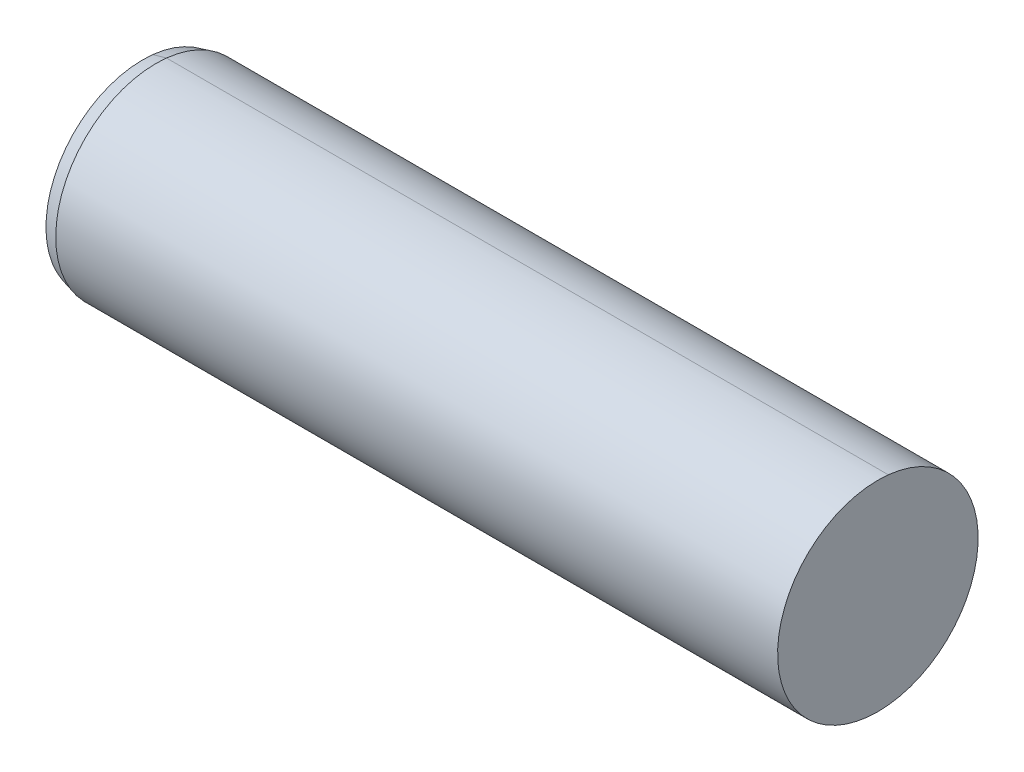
ISO-10303-21;
HEADER;
FILE_DESCRIPTION(('STEP AP214'),'2;1');
FILE_NAME('part.step','',(''),(''),'','','');
FILE_SCHEMA(('AUTOMOTIVE_DESIGN { 1 0 10303 214 1 1 1 1 }'));
ENDSEC;
DATA;
#1=APPLICATION_CONTEXT('core data for automotive mechanical design processes');
#2=APPLICATION_PROTOCOL_DEFINITION('international standard','automotive_design',2000,#1);
#3=PRODUCT_CONTEXT('',#1,'mechanical');
#4=PRODUCT('Part','Part','',(#3));
#5=PRODUCT_RELATED_PRODUCT_CATEGORY('part','',(#4));
#6=PRODUCT_DEFINITION_FORMATION('','',#4);
#7=PRODUCT_DEFINITION_CONTEXT('part definition',#1,'design');
#8=PRODUCT_DEFINITION('design','',#6,#7);
#9=PRODUCT_DEFINITION_SHAPE('','',#8);
#10=(LENGTH_UNIT() NAMED_UNIT(*) SI_UNIT(.MILLI.,.METRE.));
#11=(NAMED_UNIT(*) PLANE_ANGLE_UNIT() SI_UNIT($,.RADIAN.));
#12=(NAMED_UNIT(*) SI_UNIT($,.STERADIAN.) SOLID_ANGLE_UNIT());
#13=UNCERTAINTY_MEASURE_WITH_UNIT(LENGTH_MEASURE(1.E-05),#10,'distance_accuracy_value','');
#14=(GEOMETRIC_REPRESENTATION_CONTEXT(3) GLOBAL_UNCERTAINTY_ASSIGNED_CONTEXT((#13)) GLOBAL_UNIT_ASSIGNED_CONTEXT((#10,
#11,#12)) REPRESENTATION_CONTEXT('',''));
#15=CARTESIAN_POINT('',(0.,0.,0.));
#16=DIRECTION('',(0.,0.,1.));
#17=DIRECTION('',(1.,0.,0.));
#18=AXIS2_PLACEMENT_3D('',#15,#16,#17);
#19=CARTESIAN_POINT('',(-23.85,0.,0.));
#20=DIRECTION('',(1.,0.,0.));
#21=DIRECTION('',(0.,-0.994521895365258,0.104528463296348));
#22=AXIS2_PLACEMENT_3D('',#19,#20,#21);
#23=CONICAL_SURFACE('',#22,2.9464101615,0.261799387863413);
#24=DIRECTION('',(0.965925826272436,0.257401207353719,-0.0270539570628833));
#25=VECTOR('',#24,1.);
#26=CARTESIAN_POINT('',(-23.85,2.93026941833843,-0.307983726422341));
#27=LINE('',#26,#25);
#28=CARTESIAN_POINT('',(-24.05,2.8769731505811,-0.302382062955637));
#29=VERTEX_POINT('',#28);
#30=CARTESIAN_POINT('',(-23.65,2.98356568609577,-0.313585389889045));
#31=VERTEX_POINT('',#30);
#32=EDGE_CURVE('E99',#29,#31,#27,.T.);
#33=ORIENTED_EDGE('',*,*,#32,.F.);
#34=CARTESIAN_POINT('',(-24.05,0.,0.));
#35=DIRECTION('',(-1.,0.,0.));
#36=DIRECTION('',(0.,-0.994521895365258,0.104528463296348));
#37=AXIS2_PLACEMENT_3D('',#34,#35,#36);
#38=CIRCLE('',#37,2.892820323);
#39=CARTESIAN_POINT('',(-24.05,-2.33416610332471,1.70882357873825));
#40=VERTEX_POINT('',#39);
#41=EDGE_CURVE('E19',#40,#29,#38,.T.);
#42=ORIENTED_EDGE('',*,*,#41,.F.);
#43=CARTESIAN_POINT('',(-24.05,-2.33416610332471,1.70882357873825));
#44=CARTESIAN_POINT('',(-23.8630282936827,-2.32375781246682,1.80785185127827));
#45=CARTESIAN_POINT('',(-23.65,-2.31296389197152,1.91054914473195));
#46=(BOUNDED_CURVE() B_SPLINE_CURVE(2,(#43,#44,#45),.UNSPECIFIED.,.F.,
.F.) B_SPLINE_CURVE_WITH_KNOTS((3,3),(0.,0.448509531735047),
.UNSPECIFIED.) CURVE() GEOMETRIC_REPRESENTATION_ITEM() RATIONAL_B_SPLINE_CURVE((1.,
1.00059292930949,1.)) REPRESENTATION_ITEM(''));
#47=CARTESIAN_POINT('',(-23.65,-2.31296389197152,1.91054914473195));
#48=VERTEX_POINT('',#47);
#49=EDGE_CURVE('E11',#40,#48,#46,.T.);
#50=ORIENTED_EDGE('',*,*,#49,.T.);
#51=CARTESIAN_POINT('',(-23.65,0.,0.));
#52=DIRECTION('',(1.,0.,0.));
#53=DIRECTION('',(0.,0.994521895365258,-0.104528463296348));
#54=AXIS2_PLACEMENT_3D('',#51,#52,#53);
#55=CIRCLE('',#54,3.);
#56=EDGE_CURVE('E116',#31,#48,#55,.T.);
#57=ORIENTED_EDGE('',*,*,#56,.F.);
#58=EDGE_LOOP('',(#33,#42,#50,#57));
#59=FACE_BOUND('',#58,.T.);
#60=ADVANCED_FACE('F16',(#59),#23,.T.);
#61=CARTESIAN_POINT('',(-13.05,0.,0.));
#62=DIRECTION('',(-1.,0.,0.));
#63=DIRECTION('',(0.,0.994521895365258,-0.104528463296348));
#64=AXIS2_PLACEMENT_3D('',#61,#62,#63);
#65=CYLINDRICAL_SURFACE('',#64,3.);
#66=DIRECTION('',(-1.,0.,0.));
#67=VECTOR('',#66,1.);
#68=CARTESIAN_POINT('',(-13.05,2.98356568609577,-0.313585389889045));
#69=LINE('',#68,#67);
#70=CARTESIAN_POINT('',(-2.05,2.98356568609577,-0.313585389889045));
#71=VERTEX_POINT('',#70);
#72=EDGE_CURVE('E119',#71,#31,#69,.T.);
#73=ORIENTED_EDGE('',*,*,#72,.F.);
#74=CARTESIAN_POINT('',(-2.05,0.,0.));
#75=DIRECTION('',(1.,0.,0.));
#76=DIRECTION('',(0.,0.994521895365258,-0.104528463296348));
#77=AXIS2_PLACEMENT_3D('',#74,#75,#76);
#78=CIRCLE('',#77,3.);
#79=CARTESIAN_POINT('',(-2.05,-2.98356568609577,0.313585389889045));
#80=VERTEX_POINT('',#79);
#81=EDGE_CURVE('E87',#80,#71,#78,.T.);
#82=ORIENTED_EDGE('',*,*,#81,.F.);
#83=DIRECTION('',(1.,0.,0.));
#84=VECTOR('',#83,1.);
#85=CARTESIAN_POINT('',(-13.05,-2.98356568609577,0.313585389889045));
#86=LINE('',#85,#84);
#87=CARTESIAN_POINT('',(-12.05,-2.98356568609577,0.313585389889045));
#88=VERTEX_POINT('',#87);
#89=EDGE_CURVE('E92',#88,#80,#86,.T.);
#90=ORIENTED_EDGE('',*,*,#89,.F.);
#91=CARTESIAN_POINT('',(-12.05,0.,0.));
#92=DIRECTION('',(1.,0.,0.));
#93=DIRECTION('',(0.,0.994521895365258,-0.104528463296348));
#94=AXIS2_PLACEMENT_3D('',#91,#92,#93);
#95=CIRCLE('',#94,3.);
#96=CARTESIAN_POINT('',(-12.05,-2.6596455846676,-1.38790682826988));
#97=VERTEX_POINT('',#96);
#98=EDGE_CURVE('E26',#88,#97,#95,.T.);
#99=ORIENTED_EDGE('',*,*,#98,.T.);
#100=DIRECTION('',(-1.,0.,0.));
#101=VECTOR('',#100,1.);
#102=CARTESIAN_POINT('',(-17.85,-2.6596455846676,-1.38790682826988));
#103=LINE('',#102,#101);
#104=CARTESIAN_POINT('',(-23.65,-2.6596455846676,-1.38790682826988));
#105=VERTEX_POINT('',#104);
#106=EDGE_CURVE('E104',#97,#105,#103,.T.);
#107=ORIENTED_EDGE('',*,*,#106,.T.);
#108=CARTESIAN_POINT('',(-23.65,0.,0.));
#109=DIRECTION('',(1.,0.,0.));
#110=DIRECTION('',(0.,0.994521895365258,-0.104528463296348));
#111=AXIS2_PLACEMENT_3D('',#108,#109,#110);
#112=CIRCLE('',#111,3.);
#113=EDGE_CURVE('E136',#105,#31,#112,.T.);
#114=ORIENTED_EDGE('',*,*,#113,.T.);
#115=EDGE_LOOP('',(#73,#82,#90,#99,#107,#114));
#116=FACE_BOUND('',#115,.T.);
#117=ADVANCED_FACE('F93',(#116),#65,.T.);
#118=CARTESIAN_POINT('',(-12.05,-2.73493521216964,0.287453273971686));
#119=DIRECTION('',(-1.,0.,0.));
#120=DIRECTION('',(0.,0.,1.));
#121=AXIS2_PLACEMENT_3D('',#118,#119,#120);
#122=PLANE('',#121);
#123=CARTESIAN_POINT('',(-12.05,0.,0.));
#124=DIRECTION('',(1.,0.,0.));
#125=DIRECTION('',(0.,0.994521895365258,-0.104528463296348));
#126=AXIS2_PLACEMENT_3D('',#123,#124,#125);
#127=CIRCLE('',#126,3.);
#128=CARTESIAN_POINT('',(-12.05,-2.31296389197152,1.91054914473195));
#129=VERTEX_POINT('',#128);
#130=EDGE_CURVE('E66',#129,#88,#127,.T.);
#131=ORIENTED_EDGE('',*,*,#130,.F.);
#132=DIRECTION('',(0.,-0.104528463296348,-0.994521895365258));
#133=VECTOR('',#132,1.);
#134=CARTESIAN_POINT('',(-12.05,-2.48630473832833,0.261321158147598));
#135=LINE('',#134,#133);
#136=EDGE_CURVE('E102',#129,#97,#135,.T.);
#137=ORIENTED_EDGE('',*,*,#136,.T.);
#138=ORIENTED_EDGE('',*,*,#98,.F.);
#139=EDGE_LOOP('',(#131,#137,#138));
#140=FACE_BOUND('',#139,.T.);
#141=ADVANCED_FACE('F101',(#140),#122,.T.);
#142=CARTESIAN_POINT('',(-18.05,-2.48630473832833,0.261321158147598));
#143=DIRECTION('',(0.,-0.994521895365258,0.104528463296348));
#144=DIRECTION('',(-1.,0.,0.));
#145=AXIS2_PLACEMENT_3D('',#142,#143,#144);
#146=PLANE('',#145);
#147=DIRECTION('',(1.,0.,0.));
#148=VECTOR('',#147,1.);
#149=CARTESIAN_POINT('',(-17.85,-2.31296389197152,1.91054914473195));
#150=LINE('',#149,#148);
#151=EDGE_CURVE('E110',#48,#129,#150,.T.);
#152=ORIENTED_EDGE('',*,*,#151,.F.);
#153=ORIENTED_EDGE('',*,*,#49,.F.);
#154=DIRECTION('',(0.,0.104528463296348,0.994521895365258));
#155=VECTOR('',#154,1.);
#156=CARTESIAN_POINT('',(-24.05,-2.48630473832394,0.261321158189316));
#157=LINE('',#156,#155);
#158=CARTESIAN_POINT('',(-24.05,-2.63844337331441,-1.18618126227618));
#159=VERTEX_POINT('',#158);
#160=EDGE_CURVE('E78',#159,#40,#157,.T.);
#161=ORIENTED_EDGE('',*,*,#160,.F.);
#162=CARTESIAN_POINT('',(-23.65,-2.6596455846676,-1.38790682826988));
#163=CARTESIAN_POINT('',(-23.8630282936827,-2.6488516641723,-1.28520953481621));
#164=CARTESIAN_POINT('',(-24.05,-2.63844337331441,-1.18618126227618));
#165=(BOUNDED_CURVE() B_SPLINE_CURVE(2,(#162,#163,#164),.UNSPECIFIED.,.F.,
.F.) B_SPLINE_CURVE_WITH_KNOTS((3,3),(0.,0.448509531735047),
.UNSPECIFIED.) CURVE() GEOMETRIC_REPRESENTATION_ITEM() RATIONAL_B_SPLINE_CURVE((1.,
1.00059292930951,1.)) REPRESENTATION_ITEM(''));
#166=EDGE_CURVE('E126',#105,#159,#165,.T.);
#167=ORIENTED_EDGE('',*,*,#166,.F.);
#168=ORIENTED_EDGE('',*,*,#106,.F.);
#169=ORIENTED_EDGE('',*,*,#136,.F.);
#170=EDGE_LOOP('',(#152,#153,#161,#167,#168,#169));
#171=FACE_BOUND('',#170,.T.);
#172=ADVANCED_FACE('F189',(#171),#146,.T.);
#173=CARTESIAN_POINT('',(-13.05,0.,0.));
#174=DIRECTION('',(-1.,0.,0.));
#175=DIRECTION('',(0.,0.994521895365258,-0.104528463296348));
#176=AXIS2_PLACEMENT_3D('',#173,#174,#175);
#177=CYLINDRICAL_SURFACE('',#176,3.);
#178=ORIENTED_EDGE('',*,*,#72,.T.);
#179=ORIENTED_EDGE('',*,*,#56,.T.);
#180=ORIENTED_EDGE('',*,*,#151,.T.);
#181=ORIENTED_EDGE('',*,*,#130,.T.);
#182=ORIENTED_EDGE('',*,*,#89,.T.);
#183=CARTESIAN_POINT('',(-2.05,0.,0.));
#184=DIRECTION('',(1.,0.,0.));
#185=DIRECTION('',(0.,0.994521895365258,-0.104528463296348));
#186=AXIS2_PLACEMENT_3D('',#183,#184,#185);
#187=CIRCLE('',#186,3.);
#188=EDGE_CURVE('E123',#71,#80,#187,.T.);
#189=ORIENTED_EDGE('',*,*,#188,.F.);
#190=EDGE_LOOP('',(#178,#179,#180,#181,#182,#189));
#191=FACE_BOUND('',#190,.T.);
#192=ADVANCED_FACE('F107',(#191),#177,.T.);
#193=CARTESIAN_POINT('',(-23.85,0.,0.));
#194=DIRECTION('',(1.,0.,0.));
#195=DIRECTION('',(0.,-0.994521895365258,0.104528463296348));
#196=AXIS2_PLACEMENT_3D('',#193,#194,#195);
#197=CONICAL_SURFACE('',#196,2.9464101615,0.261799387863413);
#198=ORIENTED_EDGE('',*,*,#32,.T.);
#199=ORIENTED_EDGE('',*,*,#113,.F.);
#200=ORIENTED_EDGE('',*,*,#166,.T.);
#201=CARTESIAN_POINT('',(-24.05,0.,0.));
#202=DIRECTION('',(-1.,0.,0.));
#203=DIRECTION('',(0.,-0.994521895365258,0.104528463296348));
#204=AXIS2_PLACEMENT_3D('',#201,#202,#203);
#205=CIRCLE('',#204,2.892820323);
#206=EDGE_CURVE('E143',#29,#159,#205,.T.);
#207=ORIENTED_EDGE('',*,*,#206,.F.);
#208=EDGE_LOOP('',(#198,#199,#200,#207));
#209=FACE_BOUND('',#208,.T.);
#210=ADVANCED_FACE('F165',(#209),#197,.T.);
#211=CARTESIAN_POINT('',(-2.05,0.,0.));
#212=DIRECTION('',(1.,0.,0.));
#213=DIRECTION('',(0.,1.,0.));
#214=AXIS2_PLACEMENT_3D('',#211,#212,#213);
#215=PLANE('',#214);
#216=ORIENTED_EDGE('',*,*,#188,.T.);
#217=ORIENTED_EDGE('',*,*,#81,.T.);
#218=EDGE_LOOP('',(#216,#217));
#219=FACE_BOUND('',#218,.T.);
#220=ADVANCED_FACE('F169',(#219),#215,.T.);
#221=CARTESIAN_POINT('',(-24.05,0.,0.));
#222=DIRECTION('',(-1.,0.,0.));
#223=DIRECTION('',(0.,0.,1.));
#224=AXIS2_PLACEMENT_3D('',#221,#222,#223);
#225=PLANE('',#224);
#226=ORIENTED_EDGE('',*,*,#160,.T.);
#227=ORIENTED_EDGE('',*,*,#41,.T.);
#228=ORIENTED_EDGE('',*,*,#206,.T.);
#229=EDGE_LOOP('',(#226,#227,#228));
#230=FACE_BOUND('',#229,.T.);
#231=ADVANCED_FACE('F171',(#230),#225,.T.);
#232=CLOSED_SHELL('',(#60,#117,#141,#172,#192,#210,#220,#231));
#233=MANIFOLD_SOLID_BREP('B1',#232);
#234=ADVANCED_BREP_SHAPE_REPRESENTATION('',(#18,#233),#14);
#235=SHAPE_DEFINITION_REPRESENTATION(#9,#234);
ENDSEC;
END-ISO-10303-21;
